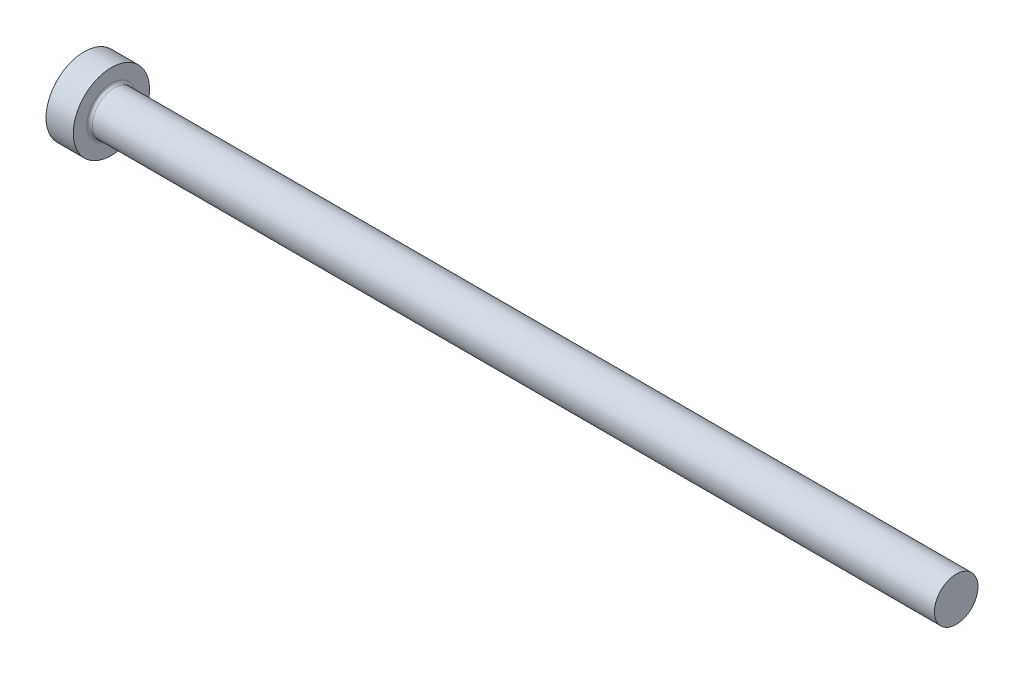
ISO-10303-21;
HEADER;
FILE_DESCRIPTION(('STEP AP214'),'2;1');
FILE_NAME('part.step','',(''),(''),'','','');
FILE_SCHEMA(('AUTOMOTIVE_DESIGN { 1 0 10303 214 1 1 1 1 }'));
ENDSEC;
DATA;
#1=APPLICATION_CONTEXT('core data for automotive mechanical design processes');
#2=APPLICATION_PROTOCOL_DEFINITION('international standard','automotive_design',2000,#1);
#3=PRODUCT_CONTEXT('',#1,'mechanical');
#4=PRODUCT('Part','Part','',(#3));
#5=PRODUCT_RELATED_PRODUCT_CATEGORY('part','',(#4));
#6=PRODUCT_DEFINITION_FORMATION('','',#4);
#7=PRODUCT_DEFINITION_CONTEXT('part definition',#1,'design');
#8=PRODUCT_DEFINITION('design','',#6,#7);
#9=PRODUCT_DEFINITION_SHAPE('','',#8);
#10=(LENGTH_UNIT() NAMED_UNIT(*) SI_UNIT(.MILLI.,.METRE.));
#11=(NAMED_UNIT(*) PLANE_ANGLE_UNIT() SI_UNIT($,.RADIAN.));
#12=(NAMED_UNIT(*) SI_UNIT($,.STERADIAN.) SOLID_ANGLE_UNIT());
#13=UNCERTAINTY_MEASURE_WITH_UNIT(LENGTH_MEASURE(1.E-05),#10,'distance_accuracy_value','');
#14=(GEOMETRIC_REPRESENTATION_CONTEXT(3) GLOBAL_UNCERTAINTY_ASSIGNED_CONTEXT((#13)) GLOBAL_UNIT_ASSIGNED_CONTEXT((#10,
#11,#12)) REPRESENTATION_CONTEXT('',''));
#15=CARTESIAN_POINT('',(0.,0.,0.));
#16=DIRECTION('',(0.,0.,1.));
#17=DIRECTION('',(1.,0.,0.));
#18=AXIS2_PLACEMENT_3D('',#15,#16,#17);
#19=CARTESIAN_POINT('',(0.,0.,0.));
#20=DIRECTION('',(-1.,0.,0.));
#21=DIRECTION('',(0.,0.,1.));
#22=AXIS2_PLACEMENT_3D('',#19,#20,#21);
#23=PLANE('',#22);
#24=CARTESIAN_POINT('',(0.,0.,0.));
#25=DIRECTION('',(-1.,0.,0.));
#26=DIRECTION('',(0.,0.,1.));
#27=AXIS2_PLACEMENT_3D('',#24,#25,#26);
#28=CIRCLE('',#27,7.);
#29=CARTESIAN_POINT('',(0.,0.,7.));
#30=VERTEX_POINT('',#29);
#31=EDGE_CURVE('E8',#30,#30,#28,.T.);
#32=ORIENTED_EDGE('',*,*,#31,.T.);
#33=EDGE_LOOP('',(#32));
#34=FACE_BOUND('',#33,.T.);
#35=ADVANCED_FACE('F10',(#34),#23,.T.);
#36=CARTESIAN_POINT('',(0.,0.,0.));
#37=DIRECTION('',(-1.,0.,0.));
#38=DIRECTION('',(0.,0.,1.));
#39=AXIS2_PLACEMENT_3D('',#36,#37,#38);
#40=CYLINDRICAL_SURFACE('',#39,7.);
#41=CARTESIAN_POINT('',(5.,0.,0.));
#42=DIRECTION('',(-1.,0.,0.));
#43=DIRECTION('',(0.,0.,1.));
#44=AXIS2_PLACEMENT_3D('',#41,#42,#43);
#45=CIRCLE('',#44,7.);
#46=CARTESIAN_POINT('',(5.,0.,7.));
#47=VERTEX_POINT('',#46);
#48=EDGE_CURVE('E16',#47,#47,#45,.T.);
#49=ORIENTED_EDGE('',*,*,#48,.T.);
#50=EDGE_LOOP('',(#49));
#51=FACE_BOUND('',#50,.T.);
#52=ORIENTED_EDGE('',*,*,#31,.F.);
#53=EDGE_LOOP('',(#52));
#54=FACE_BOUND('',#53,.T.);
#55=ADVANCED_FACE('F45',(#51,#54),#40,.T.);
#56=CARTESIAN_POINT('',(5.,7.,0.));
#57=DIRECTION('',(1.,0.,0.));
#58=DIRECTION('',(0.,0.,-1.));
#59=AXIS2_PLACEMENT_3D('',#56,#57,#58);
#60=PLANE('',#59);
#61=CARTESIAN_POINT('',(5.,0.,0.));
#62=DIRECTION('',(-1.,0.,0.));
#63=DIRECTION('',(0.,0.,1.));
#64=AXIS2_PLACEMENT_3D('',#61,#62,#63);
#65=CIRCLE('',#64,4.5);
#66=CARTESIAN_POINT('',(5.,0.,4.5));
#67=VERTEX_POINT('',#66);
#68=EDGE_CURVE('E20',#67,#67,#65,.T.);
#69=ORIENTED_EDGE('',*,*,#68,.T.);
#70=EDGE_LOOP('',(#69));
#71=FACE_BOUND('',#70,.T.);
#72=ORIENTED_EDGE('',*,*,#48,.F.);
#73=EDGE_LOOP('',(#72));
#74=FACE_BOUND('',#73,.T.);
#75=ADVANCED_FACE('F48',(#71,#74),#60,.T.);
#76=CARTESIAN_POINT('',(5.5,0.,0.));
#77=DIRECTION('',(-1.,0.,0.));
#78=DIRECTION('',(0.,0.,1.));
#79=AXIS2_PLACEMENT_3D('',#76,#77,#78);
#80=TOROIDAL_SURFACE('',#79,4.5,0.5);
#81=CARTESIAN_POINT('',(5.5,0.,0.));
#82=DIRECTION('',(-1.,0.,0.));
#83=DIRECTION('',(0.,0.,1.));
#84=AXIS2_PLACEMENT_3D('',#81,#82,#83);
#85=CIRCLE('',#84,4.);
#86=CARTESIAN_POINT('',(5.5,0.,4.));
#87=VERTEX_POINT('',#86);
#88=EDGE_CURVE('E24',#87,#87,#85,.T.);
#89=ORIENTED_EDGE('',*,*,#88,.T.);
#90=EDGE_LOOP('',(#89));
#91=FACE_BOUND('',#90,.T.);
#92=ORIENTED_EDGE('',*,*,#68,.F.);
#93=EDGE_LOOP('',(#92));
#94=FACE_BOUND('',#93,.T.);
#95=ADVANCED_FACE('F42',(#91,#94),#80,.F.);
#96=CARTESIAN_POINT('',(0.,0.,0.));
#97=DIRECTION('',(-1.,0.,0.));
#98=DIRECTION('',(0.,0.,1.));
#99=AXIS2_PLACEMENT_3D('',#96,#97,#98);
#100=CYLINDRICAL_SURFACE('',#99,4.);
#101=CARTESIAN_POINT('',(160.,0.,0.));
#102=DIRECTION('',(-1.,0.,0.));
#103=DIRECTION('',(0.,0.,1.));
#104=AXIS2_PLACEMENT_3D('',#101,#102,#103);
#105=CIRCLE('',#104,4.);
#106=CARTESIAN_POINT('',(160.,0.,4.));
#107=VERTEX_POINT('',#106);
#108=EDGE_CURVE('E29',#107,#107,#105,.T.);
#109=ORIENTED_EDGE('',*,*,#108,.T.);
#110=EDGE_LOOP('',(#109));
#111=FACE_BOUND('',#110,.T.);
#112=ORIENTED_EDGE('',*,*,#88,.F.);
#113=EDGE_LOOP('',(#112));
#114=FACE_BOUND('',#113,.T.);
#115=ADVANCED_FACE('F33',(#111,#114),#100,.T.);
#116=CARTESIAN_POINT('',(160.,4.,0.));
#117=DIRECTION('',(1.,0.,0.));
#118=DIRECTION('',(0.,0.,-1.));
#119=AXIS2_PLACEMENT_3D('',#116,#117,#118);
#120=PLANE('',#119);
#121=ORIENTED_EDGE('',*,*,#108,.F.);
#122=EDGE_LOOP('',(#121));
#123=FACE_BOUND('',#122,.T.);
#124=ADVANCED_FACE('F36',(#123),#120,.T.);
#125=CLOSED_SHELL('',(#35,#55,#75,#95,#115,#124));
#126=MANIFOLD_SOLID_BREP('B1',#125);
#127=ADVANCED_BREP_SHAPE_REPRESENTATION('',(#18,#126),#14);
#128=SHAPE_DEFINITION_REPRESENTATION(#9,#127);
ENDSEC;
END-ISO-10303-21;
